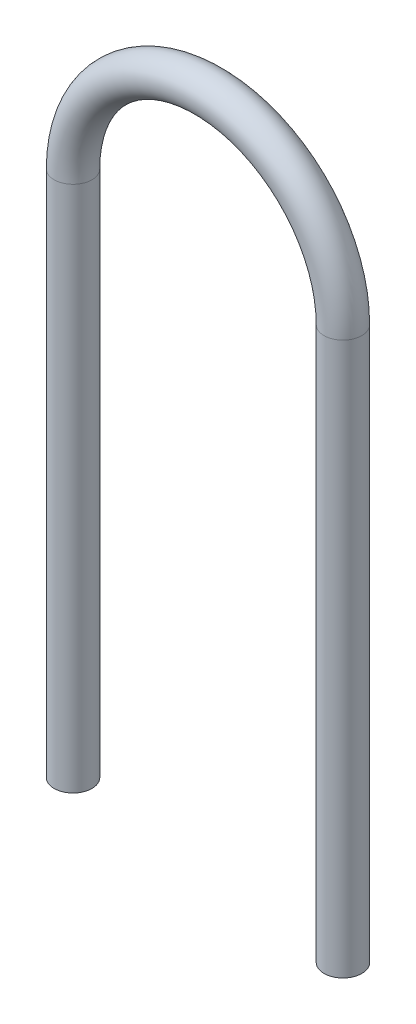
ISO-10303-21;
HEADER;
FILE_DESCRIPTION(('STEP AP214'),'2;1');
FILE_NAME('part.step','',(''),(''),'','','');
FILE_SCHEMA(('AUTOMOTIVE_DESIGN { 1 0 10303 214 1 1 1 1 }'));
ENDSEC;
DATA;
#1=APPLICATION_CONTEXT('core data for automotive mechanical design processes');
#2=APPLICATION_PROTOCOL_DEFINITION('international standard','automotive_design',2000,#1);
#3=PRODUCT_CONTEXT('',#1,'mechanical');
#4=PRODUCT('Part','Part','',(#3));
#5=PRODUCT_RELATED_PRODUCT_CATEGORY('part','',(#4));
#6=PRODUCT_DEFINITION_FORMATION('','',#4);
#7=PRODUCT_DEFINITION_CONTEXT('part definition',#1,'design');
#8=PRODUCT_DEFINITION('design','',#6,#7);
#9=PRODUCT_DEFINITION_SHAPE('','',#8);
#10=(LENGTH_UNIT() NAMED_UNIT(*) SI_UNIT(.MILLI.,.METRE.));
#11=(NAMED_UNIT(*) PLANE_ANGLE_UNIT() SI_UNIT($,.RADIAN.));
#12=(NAMED_UNIT(*) SI_UNIT($,.STERADIAN.) SOLID_ANGLE_UNIT());
#13=UNCERTAINTY_MEASURE_WITH_UNIT(LENGTH_MEASURE(1.E-05),#10,'distance_accuracy_value','');
#14=(GEOMETRIC_REPRESENTATION_CONTEXT(3) GLOBAL_UNCERTAINTY_ASSIGNED_CONTEXT((#13)) GLOBAL_UNIT_ASSIGNED_CONTEXT((#10,
#11,#12)) REPRESENTATION_CONTEXT('',''));
#15=CARTESIAN_POINT('',(0.,0.,0.));
#16=DIRECTION('',(0.,0.,1.));
#17=DIRECTION('',(1.,0.,0.));
#18=AXIS2_PLACEMENT_3D('',#15,#16,#17);
#19=CARTESIAN_POINT('',(-100.,204.67665619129,0.));
#20=DIRECTION('',(0.,-1.,0.));
#21=DIRECTION('',(1.,0.,0.));
#22=AXIS2_PLACEMENT_3D('',#19,#20,#21);
#23=CYLINDRICAL_SURFACE('',#22,7.);
#24=CARTESIAN_POINT('',(-100.,204.67665619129,0.));
#25=DIRECTION('',(0.,-1.,0.));
#26=DIRECTION('',(0.,0.,1.));
#27=AXIS2_PLACEMENT_3D('',#24,#25,#26);
#28=CIRCLE('',#27,7.);
#29=CARTESIAN_POINT('',(-107.,204.67665619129,0.));
#30=VERTEX_POINT('',#29);
#31=EDGE_CURVE('E37',#30,#30,#28,.T.);
#32=ORIENTED_EDGE('',*,*,#31,.T.);
#33=EDGE_LOOP('',(#32));
#34=FACE_BOUND('',#33,.T.);
#35=CARTESIAN_POINT('',(-100.,9.35331238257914,0.));
#36=DIRECTION('',(0.,-1.,0.));
#37=DIRECTION('',(0.,0.,1.));
#38=AXIS2_PLACEMENT_3D('',#35,#36,#37);
#39=CIRCLE('',#38,7.);
#40=CARTESIAN_POINT('',(-100.,9.35331238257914,7.));
#41=VERTEX_POINT('',#40);
#42=EDGE_CURVE('E10',#41,#41,#39,.T.);
#43=ORIENTED_EDGE('',*,*,#42,.F.);
#44=EDGE_LOOP('',(#43));
#45=FACE_BOUND('',#44,.T.);
#46=ADVANCED_FACE('F31',(#34,#45),#23,.T.);
#47=CARTESIAN_POINT('',(-50.,204.67665619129,0.));
#48=DIRECTION('',(0.,0.,1.));
#49=DIRECTION('',(1.,0.,0.));
#50=AXIS2_PLACEMENT_3D('',#47,#48,#49);
#51=TOROIDAL_SURFACE('',#50,50.,7.);
#52=CARTESIAN_POINT('',(0.,204.67665619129,0.));
#53=DIRECTION('',(0.,1.,0.));
#54=DIRECTION('',(0.,0.,1.));
#55=AXIS2_PLACEMENT_3D('',#52,#53,#54);
#56=CIRCLE('',#55,7.);
#57=CARTESIAN_POINT('',(7.,204.67665619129,0.));
#58=VERTEX_POINT('',#57);
#59=EDGE_CURVE('E41',#58,#58,#56,.T.);
#60=CARTESIAN_POINT('',(-50.,204.67665619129,0.));
#61=DIRECTION('',(0.,0.,1.));
#62=DIRECTION('',(1.,0.,0.));
#63=AXIS2_PLACEMENT_3D('',#60,#61,#62);
#64=CIRCLE('',#63,57.);
#65=EDGE_CURVE('',#58,#30,#64,.T.);
#66=ORIENTED_EDGE('',*,*,#59,.T.);
#67=ORIENTED_EDGE('',*,*,#31,.F.);
#68=ORIENTED_EDGE('',*,*,#65,.T.);
#69=ORIENTED_EDGE('',*,*,#65,.F.);
#70=EDGE_LOOP('',(#66,#68,#67,#69));
#71=FACE_BOUND('',#70,.T.);
#72=ADVANCED_FACE('F63',(#71),#51,.T.);
#73=CARTESIAN_POINT('',(0.,204.67665619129,0.));
#74=DIRECTION('',(0.,-1.,0.));
#75=DIRECTION('',(0.,0.,-1.));
#76=AXIS2_PLACEMENT_3D('',#73,#74,#75);
#77=CYLINDRICAL_SURFACE('',#76,7.);
#78=ORIENTED_EDGE('',*,*,#59,.F.);
#79=EDGE_LOOP('',(#78));
#80=FACE_BOUND('',#79,.T.);
#81=CARTESIAN_POINT('',(0.,0.,0.));
#82=DIRECTION('',(0.,1.,0.));
#83=DIRECTION('',(0.,0.,1.));
#84=AXIS2_PLACEMENT_3D('',#81,#82,#83);
#85=CIRCLE('',#84,7.);
#86=CARTESIAN_POINT('',(0.,0.,7.));
#87=VERTEX_POINT('',#86);
#88=EDGE_CURVE('E45',#87,#87,#85,.T.);
#89=ORIENTED_EDGE('',*,*,#88,.T.);
#90=EDGE_LOOP('',(#89));
#91=FACE_BOUND('',#90,.T.);
#92=ADVANCED_FACE('F51',(#80,#91),#77,.T.);
#93=CARTESIAN_POINT('',(-100.,9.35331238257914,0.));
#94=DIRECTION('',(0.,-1.,0.));
#95=DIRECTION('',(0.,0.,1.));
#96=AXIS2_PLACEMENT_3D('',#93,#94,#95);
#97=PLANE('',#96);
#98=ORIENTED_EDGE('',*,*,#42,.T.);
#99=EDGE_LOOP('',(#98));
#100=FACE_BOUND('',#99,.T.);
#101=ADVANCED_FACE('F55',(#100),#97,.T.);
#102=CARTESIAN_POINT('',(0.,0.,0.));
#103=DIRECTION('',(0.,1.,0.));
#104=DIRECTION('',(0.,0.,1.));
#105=AXIS2_PLACEMENT_3D('',#102,#103,#104);
#106=PLANE('',#105);
#107=ORIENTED_EDGE('',*,*,#88,.F.);
#108=EDGE_LOOP('',(#107));
#109=FACE_BOUND('',#108,.T.);
#110=ADVANCED_FACE('F53',(#109),#106,.F.);
#111=CLOSED_SHELL('',(#46,#72,#92,#101,#110));
#112=MANIFOLD_SOLID_BREP('B2',#111);
#113=ADVANCED_BREP_SHAPE_REPRESENTATION('',(#18,#112),#14);
#114=SHAPE_DEFINITION_REPRESENTATION(#9,#113);
ENDSEC;
END-ISO-10303-21;
